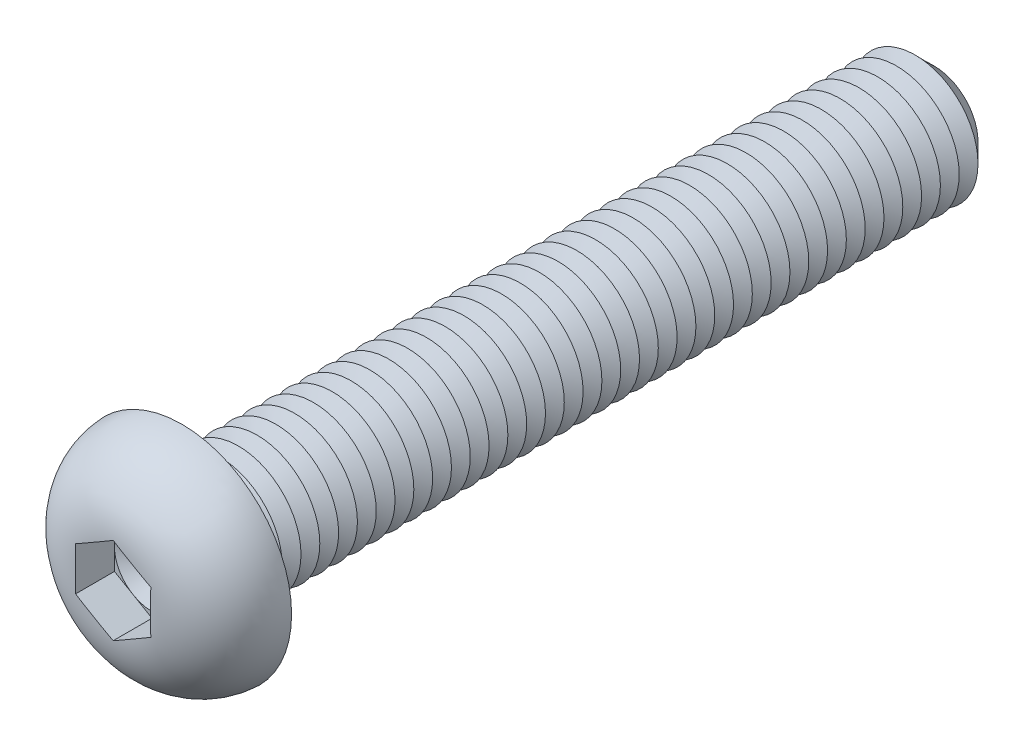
from build123d import *

# Parameters (mm, degrees)
CUT_EXTRUDE1_DEPTH  = 3.12
SKETCH4_R           = 5
BOSS_EXTRUDE1_DEPTH = 60
CHAMFER1_SIZE       = 1.5
LPATTERN1_COUNT     = 38
LPATTERN1_PITCH     = 1.5
FILLET2_R           = 0.6


with BuildPart() as part:
    # Sketch2 → Revolve1 (revolve)
    with BuildSketch(Plane(origin=(0, 0, 0), x_dir=(0, 0, -1), z_dir=(1, 0, 0)), mode=Mode.PRIVATE) as revolve1_sk:
        with BuildLine():
            Line((0, 0), (-5.5, 0))
            Line((-5.5, 0), (-5.5, 2.957763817))
            ThreePointArc((-5.5, 2.957763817), (-3.905948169, 6.951508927), (0, 8.75))
            Line((0, 8.75), (0, 0))
        make_face()
    revolve(revolve1_sk.sketch.rotate(Axis((0, 0, 47.934239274), (0, 0, -1)), 90), axis=Axis((0, 0, 47.934239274), (0, 0, -1)))

    # Sketch3 → Cut-Extrude1 (cut)
    with BuildSketch(Plane.XY.offset(5.5)):
        Polygon((0, 3.464101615), (-3, 1.732050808), (-3, -1.732050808), (0, -3.464101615), (3, -1.732050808), (3, 1.732050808), align=None)
    extrude(amount=-CUT_EXTRUDE1_DEPTH, mode=Mode.SUBTRACT)

    # Sketch4 → Boss-Extrude1 (add)
    with BuildSketch(Plane(origin=(0, 0, 0), x_dir=(-1, 0, 0), z_dir=(0, 0, -1))):
        with Locations(Location((0, 0, 0), (0, 0, 180))):
            Circle(SKETCH4_R)
    extrude(amount=BOSS_EXTRUDE1_DEPTH)

    # Chamfer1
    chamfer1_edges = [part.edges().sort_by_distance(p)[0] for p in [
        (-5, 0, -60),
    ]]
    chamfer(chamfer1_edges, length=CHAMFER1_SIZE)

    # Sketch5 → Cut-Revolve1 (revolve, cut)
    with BuildSketch(Plane(origin=(0, 0, 0), x_dir=(0, 0, -1), z_dir=(1, 0, 0)), mode=Mode.PRIVATE) as cut_revolve1_sk:
        Polygon((1.5, 5), (3, 5), (2.25, 3.700961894), align=None)
    cut_revolve1 = revolve(cut_revolve1_sk.sketch.rotate(Axis((0, 0, 47.934239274), (0, 0, -1)), 90), axis=Axis((0, 0, 47.934239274), (0, 0, -1)), mode=Mode.SUBTRACT)

    # LPattern1: Cut-Revolve1 ×38
    with Locations(*[(0, 0, -i * LPATTERN1_PITCH) for i in range(1, LPATTERN1_COUNT)]):
        add(cut_revolve1, mode=Mode.SUBTRACT)

    # Fillet2
    fillet2_edges = [part.edges().sort_by_distance(p)[0] for p in [
        (-5, 0, 0),
    ]]
    fillet(fillet2_edges, radius=FILLET2_R)

    # Cut-Extrude2 cone 1 section (on through the dimple's axis) → Cut-Extrude2 (revolve, cut)
    with BuildSketch(Plane(origin=(0, 0, 2.38), x_dir=(0, -1, 0), z_dir=(1, 0, 0))):
        Polygon((0, 0), (3, 0), (0, 1.732050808), align=None)
    revolve(axis=Axis((0, 0, 2.38), (0, 0, -1)), mode=Mode.SUBTRACT)


solid = part.part
